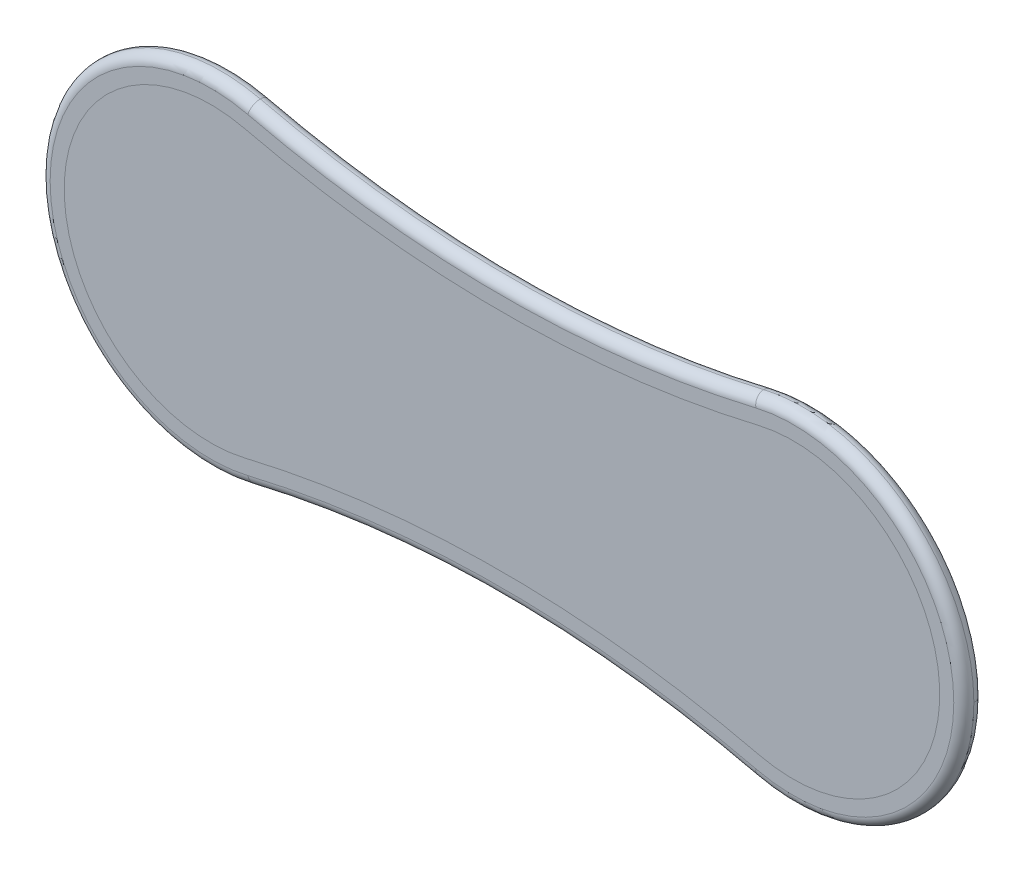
ISO-10303-21;
HEADER;
FILE_DESCRIPTION(('STEP AP214'),'2;1');
FILE_NAME('part.step','',(''),(''),'','','');
FILE_SCHEMA(('AUTOMOTIVE_DESIGN { 1 0 10303 214 1 1 1 1 }'));
ENDSEC;
DATA;
#1=APPLICATION_CONTEXT('core data for automotive mechanical design processes');
#2=APPLICATION_PROTOCOL_DEFINITION('international standard','automotive_design',2000,#1);
#3=PRODUCT_CONTEXT('',#1,'mechanical');
#4=PRODUCT('Part','Part','',(#3));
#5=PRODUCT_RELATED_PRODUCT_CATEGORY('part','',(#4));
#6=PRODUCT_DEFINITION_FORMATION('','',#4);
#7=PRODUCT_DEFINITION_CONTEXT('part definition',#1,'design');
#8=PRODUCT_DEFINITION('design','',#6,#7);
#9=PRODUCT_DEFINITION_SHAPE('','',#8);
#10=(LENGTH_UNIT() NAMED_UNIT(*) SI_UNIT(.MILLI.,.METRE.));
#11=(NAMED_UNIT(*) PLANE_ANGLE_UNIT() SI_UNIT($,.RADIAN.));
#12=(NAMED_UNIT(*) SI_UNIT($,.STERADIAN.) SOLID_ANGLE_UNIT());
#13=UNCERTAINTY_MEASURE_WITH_UNIT(LENGTH_MEASURE(1.E-05),#10,'distance_accuracy_value','');
#14=(GEOMETRIC_REPRESENTATION_CONTEXT(3) GLOBAL_UNCERTAINTY_ASSIGNED_CONTEXT((#13)) GLOBAL_UNIT_ASSIGNED_CONTEXT((#10,
#11,#12)) REPRESENTATION_CONTEXT('',''));
#15=CARTESIAN_POINT('',(0.,0.,0.));
#16=DIRECTION('',(0.,0.,1.));
#17=DIRECTION('',(1.,0.,0.));
#18=AXIS2_PLACEMENT_3D('',#15,#16,#17);
#19=CARTESIAN_POINT('',(-72.5,0.,2.5));
#20=DIRECTION('',(0.,0.,1.));
#21=DIRECTION('',(1.,0.,0.));
#22=AXIS2_PLACEMENT_3D('',#19,#20,#21);
#23=TOROIDAL_SURFACE('',#22,40.,2.5);
#24=CARTESIAN_POINT('',(-72.5,0.,2.5));
#25=DIRECTION('',(0.,0.,1.));
#26=DIRECTION('',(1.,0.,0.));
#27=AXIS2_PLACEMENT_3D('',#24,#25,#26);
#28=CIRCLE('',#27,42.5);
#29=CARTESIAN_POINT('',(-62.6696068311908,-41.3474711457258,2.5));
#30=VERTEX_POINT('',#29);
#31=CARTESIAN_POINT('',(-115.,0.,2.5));
#32=VERTEX_POINT('',#31);
#33=EDGE_CURVE('E195',#30,#32,#28,.F.);
#34=ORIENTED_EDGE('',*,*,#33,.T.);
#35=CARTESIAN_POINT('',(-112.5,0.,2.5));
#36=DIRECTION('',(0.,1.,0.));
#37=DIRECTION('',(-1.,0.,0.));
#38=AXIS2_PLACEMENT_3D('',#35,#36,#37);
#39=CIRCLE('',#38,2.5);
#40=CARTESIAN_POINT('',(-112.5,0.,0.));
#41=VERTEX_POINT('',#40);
#42=EDGE_CURVE('E11',#32,#41,#39,.F.);
#43=ORIENTED_EDGE('',*,*,#42,.T.);
#44=CARTESIAN_POINT('',(-72.5,0.,0.));
#45=DIRECTION('',(0.,0.,1.));
#46=DIRECTION('',(1.,0.,0.));
#47=AXIS2_PLACEMENT_3D('',#44,#45,#46);
#48=CIRCLE('',#47,40.);
#49=CARTESIAN_POINT('',(-63.2478652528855,-38.9152669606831,0.));
#50=VERTEX_POINT('',#49);
#51=EDGE_CURVE('E139',#50,#41,#48,.F.);
#52=ORIENTED_EDGE('',*,*,#51,.F.);
#53=CARTESIAN_POINT('',(-63.2478652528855,-38.9152669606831,2.5));
#54=DIRECTION('',(0.972881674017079,0.23130336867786,0.));
#55=DIRECTION('',(-0.23130336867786,0.972881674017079,0.));
#56=AXIS2_PLACEMENT_3D('',#53,#54,#55);
#57=CIRCLE('',#56,2.5);
#58=EDGE_CURVE('E192',#30,#50,#57,.T.);
#59=ORIENTED_EDGE('',*,*,#58,.F.);
#60=EDGE_LOOP('',(#34,#43,#52,#59));
#61=FACE_BOUND('',#60,.T.);
#62=ADVANCED_FACE('F35',(#61),#23,.T.);
#63=CARTESIAN_POINT('',(72.5,0.,2.5));
#64=DIRECTION('',(0.,0.,1.));
#65=DIRECTION('',(1.,0.,0.));
#66=AXIS2_PLACEMENT_3D('',#63,#64,#65);
#67=TOROIDAL_SURFACE('',#66,40.,2.5);
#68=CARTESIAN_POINT('',(72.5,0.,0.));
#69=DIRECTION('',(0.,0.,1.));
#70=DIRECTION('',(1.,0.,0.));
#71=AXIS2_PLACEMENT_3D('',#68,#69,#70);
#72=CIRCLE('',#71,40.);
#73=CARTESIAN_POINT('',(112.5,0.,0.));
#74=VERTEX_POINT('',#73);
#75=CARTESIAN_POINT('',(63.2478652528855,-38.9152669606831,0.));
#76=VERTEX_POINT('',#75);
#77=EDGE_CURVE('E162',#74,#76,#72,.F.);
#78=ORIENTED_EDGE('',*,*,#77,.F.);
#79=CARTESIAN_POINT('',(112.5,0.,2.5));
#80=DIRECTION('',(0.,1.,0.));
#81=DIRECTION('',(-1.,0.,0.));
#82=AXIS2_PLACEMENT_3D('',#79,#80,#81);
#83=CIRCLE('',#82,2.5);
#84=CARTESIAN_POINT('',(115.,0.,2.5));
#85=VERTEX_POINT('',#84);
#86=EDGE_CURVE('E45',#74,#85,#83,.F.);
#87=ORIENTED_EDGE('',*,*,#86,.T.);
#88=CARTESIAN_POINT('',(72.5,0.,2.5));
#89=DIRECTION('',(0.,0.,1.));
#90=DIRECTION('',(1.,0.,0.));
#91=AXIS2_PLACEMENT_3D('',#88,#89,#90);
#92=CIRCLE('',#91,42.5);
#93=CARTESIAN_POINT('',(62.6696068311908,-41.3474711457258,2.5));
#94=VERTEX_POINT('',#93);
#95=EDGE_CURVE('E176',#85,#94,#92,.F.);
#96=ORIENTED_EDGE('',*,*,#95,.T.);
#97=CARTESIAN_POINT('',(63.2478652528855,-38.9152669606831,2.5));
#98=DIRECTION('',(0.972881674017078,-0.231303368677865,0.));
#99=DIRECTION('',(0.231303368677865,0.972881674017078,0.));
#100=AXIS2_PLACEMENT_3D('',#97,#98,#99);
#101=CIRCLE('',#100,2.5);
#102=EDGE_CURVE('E149',#94,#76,#101,.T.);
#103=ORIENTED_EDGE('',*,*,#102,.T.);
#104=EDGE_LOOP('',(#78,#87,#96,#103));
#105=FACE_BOUND('',#104,.T.);
#106=ADVANCED_FACE('F290',(#105),#67,.T.);
#107=CARTESIAN_POINT('',(36.25,152.470588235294,0.));
#108=DIRECTION('',(0.,0.,1.));
#109=DIRECTION('',(1.,0.,0.));
#110=AXIS2_PLACEMENT_3D('',#107,#108,#109);
#111=PLANE('',#110);
#112=DIRECTION('',(-1.,0.,0.));
#113=VECTOR('',#112,1.);
#114=CARTESIAN_POINT('',(36.2499999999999,0.,0.));
#115=LINE('',#114,#113);
#116=CARTESIAN_POINT('',(109.,0.,0.));
#117=VERTEX_POINT('',#116);
#118=EDGE_CURVE('E232',#74,#117,#115,.T.);
#119=ORIENTED_EDGE('',*,*,#118,.F.);
#120=ORIENTED_EDGE('',*,*,#77,.T.);
#121=CARTESIAN_POINT('',(0.,-304.94117647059,0.));
#122=DIRECTION('',(0.,0.,1.));
#123=DIRECTION('',(1.,0.,0.));
#124=AXIS2_PLACEMENT_3D('',#121,#122,#123);
#125=CIRCLE('',#124,273.44117647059);
#126=EDGE_CURVE('E160',#76,#50,#125,.T.);
#127=ORIENTED_EDGE('',*,*,#126,.T.);
#128=ORIENTED_EDGE('',*,*,#51,.T.);
#129=CARTESIAN_POINT('',(-109.,0.,0.));
#130=VERTEX_POINT('',#129);
#131=EDGE_CURVE('E137',#130,#41,#115,.T.);
#132=ORIENTED_EDGE('',*,*,#131,.F.);
#133=CARTESIAN_POINT('',(-72.5,0.,0.));
#134=DIRECTION('',(0.,0.,1.));
#135=DIRECTION('',(1.,0.,0.));
#136=AXIS2_PLACEMENT_3D('',#133,#134,#135);
#137=CIRCLE('',#136,36.5);
#138=CARTESIAN_POINT('',(-64.057427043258,-35.5101811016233,0.));
#139=VERTEX_POINT('',#138);
#140=EDGE_CURVE('E227',#139,#130,#137,.F.);
#141=ORIENTED_EDGE('',*,*,#140,.F.);
#142=CARTESIAN_POINT('',(0.,-304.94117647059,0.));
#143=DIRECTION('',(0.,0.,1.));
#144=DIRECTION('',(1.,0.,0.));
#145=AXIS2_PLACEMENT_3D('',#142,#143,#144);
#146=CIRCLE('',#145,276.94117647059);
#147=CARTESIAN_POINT('',(64.057427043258,-35.5101811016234,0.));
#148=VERTEX_POINT('',#147);
#149=EDGE_CURVE('E215',#148,#139,#146,.T.);
#150=ORIENTED_EDGE('',*,*,#149,.F.);
#151=CARTESIAN_POINT('',(72.5,0.,0.));
#152=DIRECTION('',(0.,0.,1.));
#153=DIRECTION('',(1.,0.,0.));
#154=AXIS2_PLACEMENT_3D('',#151,#152,#153);
#155=CIRCLE('',#154,36.5);
#156=EDGE_CURVE('E222',#117,#148,#155,.F.);
#157=ORIENTED_EDGE('',*,*,#156,.F.);
#158=EDGE_LOOP('',(#119,#120,#127,#128,#132,#141,#150,#157));
#159=FACE_BOUND('',#158,.T.);
#160=ADVANCED_FACE('F255',(#159),#111,.F.);
#161=DIRECTION('',(-1.,0.,0.));
#162=VECTOR('',#161,1.);
#163=CARTESIAN_POINT('',(36.2499999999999,0.,0.));
#164=LINE('',#163,#162);
#165=EDGE_CURVE('E39',#117,#130,#164,.T.);
#166=ORIENTED_EDGE('',*,*,#165,.F.);
#167=ORIENTED_EDGE('',*,*,#156,.T.);
#168=ORIENTED_EDGE('',*,*,#149,.T.);
#169=ORIENTED_EDGE('',*,*,#140,.T.);
#170=EDGE_LOOP('',(#166,#167,#168,#169));
#171=FACE_BOUND('',#170,.T.);
#172=ADVANCED_FACE('F252',(#171),#111,.F.);
#173=CARTESIAN_POINT('',(63.2478652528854,38.9152669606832,0.));
#174=VERTEX_POINT('',#173);
#175=EDGE_CURVE('E163',#174,#74,#72,.F.);
#176=ORIENTED_EDGE('',*,*,#175,.T.);
#177=ORIENTED_EDGE('',*,*,#118,.T.);
#178=CARTESIAN_POINT('',(64.057427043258,35.5101811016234,0.));
#179=VERTEX_POINT('',#178);
#180=EDGE_CURVE('E218',#179,#117,#155,.F.);
#181=ORIENTED_EDGE('',*,*,#180,.F.);
#182=CARTESIAN_POINT('',(0.,304.941176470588,0.));
#183=DIRECTION('',(0.,0.,1.));
#184=DIRECTION('',(1.,0.,0.));
#185=AXIS2_PLACEMENT_3D('',#182,#183,#184);
#186=CIRCLE('',#185,276.941176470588);
#187=CARTESIAN_POINT('',(-64.0574270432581,35.5101811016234,0.));
#188=VERTEX_POINT('',#187);
#189=EDGE_CURVE('E223',#188,#179,#186,.T.);
#190=ORIENTED_EDGE('',*,*,#189,.F.);
#191=EDGE_CURVE('E214',#130,#188,#137,.F.);
#192=ORIENTED_EDGE('',*,*,#191,.F.);
#193=ORIENTED_EDGE('',*,*,#131,.T.);
#194=CARTESIAN_POINT('',(-63.2478652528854,38.9152669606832,0.));
#195=VERTEX_POINT('',#194);
#196=EDGE_CURVE('E129',#41,#195,#48,.F.);
#197=ORIENTED_EDGE('',*,*,#196,.T.);
#198=CARTESIAN_POINT('',(0.,304.941176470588,0.));
#199=DIRECTION('',(0.,0.,1.));
#200=DIRECTION('',(1.,0.,0.));
#201=AXIS2_PLACEMENT_3D('',#198,#199,#200);
#202=CIRCLE('',#201,273.441176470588);
#203=EDGE_CURVE('E134',#195,#174,#202,.T.);
#204=ORIENTED_EDGE('',*,*,#203,.T.);
#205=EDGE_LOOP('',(#176,#177,#181,#190,#192,#193,#197,#204));
#206=FACE_BOUND('',#205,.T.);
#207=ADVANCED_FACE('F132',(#206),#111,.F.);
#208=CARTESIAN_POINT('',(36.25,152.470588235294,5.));
#209=DIRECTION('',(0.,0.,1.));
#210=DIRECTION('',(1.,0.,0.));
#211=AXIS2_PLACEMENT_3D('',#208,#209,#210);
#212=PLANE('',#211);
#213=CARTESIAN_POINT('',(-72.5,0.,5.));
#214=DIRECTION('',(0.,0.,1.));
#215=DIRECTION('',(1.,0.,0.));
#216=AXIS2_PLACEMENT_3D('',#213,#214,#215);
#217=CIRCLE('',#216,40.);
#218=CARTESIAN_POINT('',(-63.2478652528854,38.9152669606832,5.));
#219=VERTEX_POINT('',#218);
#220=CARTESIAN_POINT('',(-63.2478652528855,-38.9152669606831,5.));
#221=VERTEX_POINT('',#220);
#222=EDGE_CURVE('E169',#219,#221,#217,.T.);
#223=ORIENTED_EDGE('',*,*,#222,.T.);
#224=CARTESIAN_POINT('',(0.,-304.94117647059,5.));
#225=DIRECTION('',(0.,0.,1.));
#226=DIRECTION('',(1.,0.,0.));
#227=AXIS2_PLACEMENT_3D('',#224,#225,#226);
#228=CIRCLE('',#227,273.44117647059);
#229=CARTESIAN_POINT('',(63.2478652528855,-38.9152669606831,5.));
#230=VERTEX_POINT('',#229);
#231=EDGE_CURVE('E171',#221,#230,#228,.F.);
#232=ORIENTED_EDGE('',*,*,#231,.T.);
#233=CARTESIAN_POINT('',(72.5,0.,5.));
#234=DIRECTION('',(0.,0.,1.));
#235=DIRECTION('',(1.,0.,0.));
#236=AXIS2_PLACEMENT_3D('',#233,#234,#235);
#237=CIRCLE('',#236,40.);
#238=CARTESIAN_POINT('',(63.2478652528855,38.9152669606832,5.));
#239=VERTEX_POINT('',#238);
#240=EDGE_CURVE('E165',#230,#239,#237,.T.);
#241=ORIENTED_EDGE('',*,*,#240,.T.);
#242=CARTESIAN_POINT('',(0.,304.941176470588,5.));
#243=DIRECTION('',(0.,0.,1.));
#244=DIRECTION('',(1.,0.,0.));
#245=AXIS2_PLACEMENT_3D('',#242,#243,#244);
#246=CIRCLE('',#245,273.441176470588);
#247=EDGE_CURVE('E167',#239,#219,#246,.F.);
#248=ORIENTED_EDGE('',*,*,#247,.T.);
#249=EDGE_LOOP('',(#223,#232,#241,#248));
#250=FACE_BOUND('',#249,.T.);
#251=CARTESIAN_POINT('',(72.5,0.,5.));
#252=DIRECTION('',(0.,0.,1.));
#253=DIRECTION('',(1.,0.,0.));
#254=AXIS2_PLACEMENT_3D('',#251,#252,#253);
#255=CIRCLE('',#254,36.5);
#256=CARTESIAN_POINT('',(64.057427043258,35.5101811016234,5.));
#257=VERTEX_POINT('',#256);
#258=CARTESIAN_POINT('',(64.057427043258,-35.5101811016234,5.));
#259=VERTEX_POINT('',#258);
#260=EDGE_CURVE('E207',#257,#259,#255,.F.);
#261=ORIENTED_EDGE('',*,*,#260,.T.);
#262=CARTESIAN_POINT('',(0.,-304.94117647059,5.));
#263=DIRECTION('',(0.,0.,1.));
#264=DIRECTION('',(1.,0.,0.));
#265=AXIS2_PLACEMENT_3D('',#262,#263,#264);
#266=CIRCLE('',#265,276.94117647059);
#267=CARTESIAN_POINT('',(-64.057427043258,-35.5101811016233,5.));
#268=VERTEX_POINT('',#267);
#269=EDGE_CURVE('E211',#259,#268,#266,.T.);
#270=ORIENTED_EDGE('',*,*,#269,.T.);
#271=CARTESIAN_POINT('',(-72.5,0.,5.));
#272=DIRECTION('',(0.,0.,1.));
#273=DIRECTION('',(1.,0.,0.));
#274=AXIS2_PLACEMENT_3D('',#271,#272,#273);
#275=CIRCLE('',#274,36.5);
#276=CARTESIAN_POINT('',(-64.0574270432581,35.5101811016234,5.));
#277=VERTEX_POINT('',#276);
#278=EDGE_CURVE('E174',#268,#277,#275,.F.);
#279=ORIENTED_EDGE('',*,*,#278,.T.);
#280=CARTESIAN_POINT('',(0.,304.941176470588,5.));
#281=DIRECTION('',(0.,0.,1.));
#282=DIRECTION('',(1.,0.,0.));
#283=AXIS2_PLACEMENT_3D('',#280,#281,#282);
#284=CIRCLE('',#283,276.941176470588);
#285=EDGE_CURVE('E203',#277,#257,#284,.T.);
#286=ORIENTED_EDGE('',*,*,#285,.T.);
#287=EDGE_LOOP('',(#261,#270,#279,#286));
#288=FACE_BOUND('',#287,.T.);
#289=ADVANCED_FACE('F275',(#250,#288),#212,.T.);
#290=ORIENTED_EDGE('',*,*,#269,.F.);
#291=ORIENTED_EDGE('',*,*,#260,.F.);
#292=ORIENTED_EDGE('',*,*,#285,.F.);
#293=ORIENTED_EDGE('',*,*,#278,.F.);
#294=EDGE_LOOP('',(#290,#291,#292,#293));
#295=FACE_BOUND('',#294,.T.);
#296=ADVANCED_FACE('F287',(#295),#212,.T.);
#297=ORIENTED_EDGE('',*,*,#180,.T.);
#298=ORIENTED_EDGE('',*,*,#165,.T.);
#299=ORIENTED_EDGE('',*,*,#191,.T.);
#300=ORIENTED_EDGE('',*,*,#189,.T.);
#301=EDGE_LOOP('',(#297,#298,#299,#300));
#302=FACE_BOUND('',#301,.T.);
#303=ADVANCED_FACE('F247',(#302),#111,.F.);
#304=CARTESIAN_POINT('',(-72.5,0.,2.5));
#305=DIRECTION('',(0.,0.,1.));
#306=DIRECTION('',(1.,0.,0.));
#307=AXIS2_PLACEMENT_3D('',#304,#305,#306);
#308=TOROIDAL_SURFACE('',#307,40.,2.5);
#309=CARTESIAN_POINT('',(-63.2478652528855,-38.9152669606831,2.5));
#310=DIRECTION('',(0.972881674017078,0.231303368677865,0.));
#311=DIRECTION('',(-0.231303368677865,0.972881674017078,0.));
#312=AXIS2_PLACEMENT_3D('',#309,#310,#311);
#313=CIRCLE('',#312,2.5);
#314=EDGE_CURVE('E155',#221,#30,#313,.T.);
#315=ORIENTED_EDGE('',*,*,#314,.F.);
#316=ORIENTED_EDGE('',*,*,#222,.F.);
#317=CARTESIAN_POINT('',(-63.2478652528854,38.9152669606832,2.5));
#318=DIRECTION('',(0.972881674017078,-0.231303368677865,0.));
#319=DIRECTION('',(0.231303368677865,0.972881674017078,0.));
#320=AXIS2_PLACEMENT_3D('',#317,#318,#319);
#321=CIRCLE('',#320,2.5);
#322=CARTESIAN_POINT('',(-62.6696068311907,41.3474711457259,2.5));
#323=VERTEX_POINT('',#322);
#324=EDGE_CURVE('E157',#323,#219,#321,.T.);
#325=ORIENTED_EDGE('',*,*,#324,.F.);
#326=EDGE_CURVE('E144',#32,#323,#28,.F.);
#327=ORIENTED_EDGE('',*,*,#326,.F.);
#328=ORIENTED_EDGE('',*,*,#33,.F.);
#329=EDGE_LOOP('',(#315,#316,#325,#327,#328));
#330=FACE_BOUND('',#329,.T.);
#331=ADVANCED_FACE('F37',(#330),#308,.T.);
#332=CARTESIAN_POINT('',(0.,-304.94117647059,2.5));
#333=DIRECTION('',(0.,0.,1.));
#334=DIRECTION('',(1.,0.,0.));
#335=AXIS2_PLACEMENT_3D('',#332,#333,#334);
#336=TOROIDAL_SURFACE('',#335,273.44117647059,2.5);
#337=ORIENTED_EDGE('',*,*,#231,.F.);
#338=ORIENTED_EDGE('',*,*,#314,.T.);
#339=CARTESIAN_POINT('',(0.,-304.94117647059,2.5));
#340=DIRECTION('',(0.,0.,1.));
#341=DIRECTION('',(1.,0.,0.));
#342=AXIS2_PLACEMENT_3D('',#339,#340,#341);
#343=CIRCLE('',#342,270.94117647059);
#344=EDGE_CURVE('E189',#94,#30,#343,.T.);
#345=ORIENTED_EDGE('',*,*,#344,.F.);
#346=CARTESIAN_POINT('',(63.2478652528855,-38.9152669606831,2.5));
#347=DIRECTION('',(0.972881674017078,-0.231303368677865,0.));
#348=DIRECTION('',(0.231303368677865,0.972881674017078,0.));
#349=AXIS2_PLACEMENT_3D('',#346,#347,#348);
#350=CIRCLE('',#349,2.5);
#351=EDGE_CURVE('E186',#230,#94,#350,.T.);
#352=ORIENTED_EDGE('',*,*,#351,.F.);
#353=EDGE_LOOP('',(#337,#338,#345,#352));
#354=FACE_BOUND('',#353,.T.);
#355=ADVANCED_FACE('F267',(#354),#336,.T.);
#356=CARTESIAN_POINT('',(0.,304.941176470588,2.5));
#357=DIRECTION('',(0.,0.,1.));
#358=DIRECTION('',(1.,0.,0.));
#359=AXIS2_PLACEMENT_3D('',#356,#357,#358);
#360=TOROIDAL_SURFACE('',#359,273.441176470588,2.5);
#361=ORIENTED_EDGE('',*,*,#324,.T.);
#362=ORIENTED_EDGE('',*,*,#247,.F.);
#363=CARTESIAN_POINT('',(63.2478652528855,38.9152669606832,2.5));
#364=DIRECTION('',(0.972881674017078,0.231303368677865,0.));
#365=DIRECTION('',(-0.231303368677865,0.972881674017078,0.));
#366=AXIS2_PLACEMENT_3D('',#363,#364,#365);
#367=CIRCLE('',#366,2.5);
#368=CARTESIAN_POINT('',(62.6696068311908,41.3474711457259,2.5));
#369=VERTEX_POINT('',#368);
#370=EDGE_CURVE('E183',#369,#239,#367,.T.);
#371=ORIENTED_EDGE('',*,*,#370,.F.);
#372=CARTESIAN_POINT('',(0.,304.941176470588,2.5));
#373=DIRECTION('',(0.,0.,1.));
#374=DIRECTION('',(1.,0.,0.));
#375=AXIS2_PLACEMENT_3D('',#372,#373,#374);
#376=CIRCLE('',#375,270.941176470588);
#377=EDGE_CURVE('E148',#323,#369,#376,.T.);
#378=ORIENTED_EDGE('',*,*,#377,.F.);
#379=EDGE_LOOP('',(#361,#362,#371,#378));
#380=FACE_BOUND('',#379,.T.);
#381=ADVANCED_FACE('F279',(#380),#360,.T.);
#382=ORIENTED_EDGE('',*,*,#42,.F.);
#383=ORIENTED_EDGE('',*,*,#326,.T.);
#384=CARTESIAN_POINT('',(-63.2478652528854,38.9152669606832,2.5));
#385=DIRECTION('',(0.972881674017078,-0.231303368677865,0.));
#386=DIRECTION('',(0.231303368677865,0.972881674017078,0.));
#387=AXIS2_PLACEMENT_3D('',#384,#385,#386);
#388=CIRCLE('',#387,2.5);
#389=EDGE_CURVE('E142',#195,#323,#388,.T.);
#390=ORIENTED_EDGE('',*,*,#389,.F.);
#391=ORIENTED_EDGE('',*,*,#196,.F.);
#392=EDGE_LOOP('',(#382,#383,#390,#391));
#393=FACE_BOUND('',#392,.T.);
#394=ADVANCED_FACE('F143',(#393),#23,.T.);
#395=CARTESIAN_POINT('',(0.,-304.94117647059,2.5));
#396=DIRECTION('',(0.,0.,1.));
#397=DIRECTION('',(1.,0.,0.));
#398=AXIS2_PLACEMENT_3D('',#395,#396,#397);
#399=TOROIDAL_SURFACE('',#398,273.44117647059,2.5);
#400=ORIENTED_EDGE('',*,*,#58,.T.);
#401=ORIENTED_EDGE('',*,*,#126,.F.);
#402=ORIENTED_EDGE('',*,*,#102,.F.);
#403=ORIENTED_EDGE('',*,*,#344,.T.);
#404=EDGE_LOOP('',(#400,#401,#402,#403));
#405=FACE_BOUND('',#404,.T.);
#406=ADVANCED_FACE('F261',(#405),#399,.T.);
#407=CARTESIAN_POINT('',(72.5,0.,2.5));
#408=DIRECTION('',(0.,0.,1.));
#409=DIRECTION('',(1.,0.,0.));
#410=AXIS2_PLACEMENT_3D('',#407,#408,#409);
#411=TOROIDAL_SURFACE('',#410,40.,2.5);
#412=ORIENTED_EDGE('',*,*,#240,.F.);
#413=ORIENTED_EDGE('',*,*,#351,.T.);
#414=ORIENTED_EDGE('',*,*,#95,.F.);
#415=EDGE_CURVE('E177',#369,#85,#92,.F.);
#416=ORIENTED_EDGE('',*,*,#415,.F.);
#417=ORIENTED_EDGE('',*,*,#370,.T.);
#418=EDGE_LOOP('',(#412,#413,#414,#416,#417));
#419=FACE_BOUND('',#418,.T.);
#420=ADVANCED_FACE('F271',(#419),#411,.T.);
#421=CARTESIAN_POINT('',(0.,304.941176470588,2.5));
#422=DIRECTION('',(0.,0.,1.));
#423=DIRECTION('',(1.,0.,0.));
#424=AXIS2_PLACEMENT_3D('',#421,#422,#423);
#425=TOROIDAL_SURFACE('',#424,273.441176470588,2.5);
#426=ORIENTED_EDGE('',*,*,#389,.T.);
#427=ORIENTED_EDGE('',*,*,#377,.T.);
#428=CARTESIAN_POINT('',(63.2478652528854,38.9152669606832,2.5));
#429=DIRECTION('',(0.972881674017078,0.231303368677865,0.));
#430=DIRECTION('',(-0.231303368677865,0.972881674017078,0.));
#431=AXIS2_PLACEMENT_3D('',#428,#429,#430);
#432=CIRCLE('',#431,2.5);
#433=EDGE_CURVE('E154',#174,#369,#432,.T.);
#434=ORIENTED_EDGE('',*,*,#433,.F.);
#435=ORIENTED_EDGE('',*,*,#203,.F.);
#436=EDGE_LOOP('',(#426,#427,#434,#435));
#437=FACE_BOUND('',#436,.T.);
#438=ADVANCED_FACE('F152',(#437),#425,.T.);
#439=ORIENTED_EDGE('',*,*,#86,.F.);
#440=ORIENTED_EDGE('',*,*,#175,.F.);
#441=ORIENTED_EDGE('',*,*,#433,.T.);
#442=ORIENTED_EDGE('',*,*,#415,.T.);
#443=EDGE_LOOP('',(#439,#440,#441,#442));
#444=FACE_BOUND('',#443,.T.);
#445=ADVANCED_FACE('F296',(#444),#67,.T.);
#446=CLOSED_SHELL('',(#62,#106,#160,#172,#207,#289,#296,#303,#331,#355,#381,#394,#406,#420,#438,#445));
#447=MANIFOLD_SOLID_BREP('B2',#446);
#448=ADVANCED_BREP_SHAPE_REPRESENTATION('',(#18,#447),#14);
#449=SHAPE_DEFINITION_REPRESENTATION(#9,#448);
ENDSEC;
END-ISO-10303-21;
